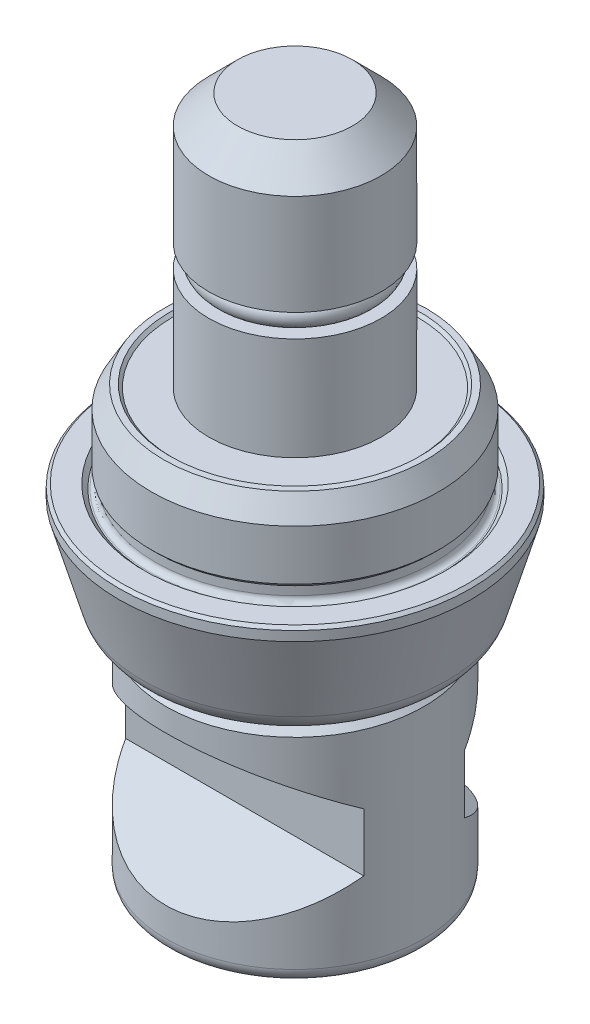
ISO-10303-21;
HEADER;
FILE_DESCRIPTION(('STEP AP214'),'2;1');
FILE_NAME('part.step','',(''),(''),'','','');
FILE_SCHEMA(('AUTOMOTIVE_DESIGN { 1 0 10303 214 1 1 1 1 }'));
ENDSEC;
DATA;
#1=APPLICATION_CONTEXT('core data for automotive mechanical design processes');
#2=APPLICATION_PROTOCOL_DEFINITION('international standard','automotive_design',2000,#1);
#3=PRODUCT_CONTEXT('',#1,'mechanical');
#4=PRODUCT('Part','Part','',(#3));
#5=PRODUCT_RELATED_PRODUCT_CATEGORY('part','',(#4));
#6=PRODUCT_DEFINITION_FORMATION('','',#4);
#7=PRODUCT_DEFINITION_CONTEXT('part definition',#1,'design');
#8=PRODUCT_DEFINITION('design','',#6,#7);
#9=PRODUCT_DEFINITION_SHAPE('','',#8);
#10=(LENGTH_UNIT() NAMED_UNIT(*) SI_UNIT(.MILLI.,.METRE.));
#11=(NAMED_UNIT(*) PLANE_ANGLE_UNIT() SI_UNIT($,.RADIAN.));
#12=(NAMED_UNIT(*) SI_UNIT($,.STERADIAN.) SOLID_ANGLE_UNIT());
#13=UNCERTAINTY_MEASURE_WITH_UNIT(LENGTH_MEASURE(1.E-05),#10,'distance_accuracy_value','');
#14=(GEOMETRIC_REPRESENTATION_CONTEXT(3) GLOBAL_UNCERTAINTY_ASSIGNED_CONTEXT((#13)) GLOBAL_UNIT_ASSIGNED_CONTEXT((#10,
#11,#12)) REPRESENTATION_CONTEXT('',''));
#15=CARTESIAN_POINT('',(0.,0.,0.));
#16=DIRECTION('',(0.,0.,1.));
#17=DIRECTION('',(1.,0.,0.));
#18=AXIS2_PLACEMENT_3D('',#15,#16,#17);
#19=CARTESIAN_POINT('',(0.,-8.4375,0.));
#20=DIRECTION('',(0.,-1.,0.));
#21=DIRECTION('',(0.,0.,1.));
#22=AXIS2_PLACEMENT_3D('',#19,#20,#21);
#23=CYLINDRICAL_SURFACE('',#22,6.);
#24=CARTESIAN_POINT('',(0.,-8.0375,0.));
#25=DIRECTION('',(0.,1.,0.));
#26=DIRECTION('',(0.,0.,-1.));
#27=AXIS2_PLACEMENT_3D('',#24,#25,#26);
#28=CIRCLE('',#27,6.);
#29=CARTESIAN_POINT('',(0.,-8.0375,-6.));
#30=VERTEX_POINT('',#29);
#31=EDGE_CURVE('E172',#30,#30,#28,.T.);
#32=ORIENTED_EDGE('',*,*,#31,.T.);
#33=EDGE_LOOP('',(#32));
#34=FACE_BOUND('',#33,.T.);
#35=CARTESIAN_POINT('',(0.,-7.8,0.));
#36=DIRECTION('',(0.,1.,0.));
#37=DIRECTION('',(0.,0.,1.));
#38=AXIS2_PLACEMENT_3D('',#35,#36,#37);
#39=CIRCLE('',#38,6.);
#40=CARTESIAN_POINT('',(0.,-7.8,6.));
#41=VERTEX_POINT('',#40);
#42=EDGE_CURVE('E695',#41,#41,#39,.F.);
#43=ORIENTED_EDGE('',*,*,#42,.T.);
#44=EDGE_LOOP('',(#43));
#45=FACE_BOUND('',#44,.T.);
#46=ADVANCED_FACE('F16',(#34,#45),#23,.T.);
#47=CARTESIAN_POINT('',(9.,-23.9375,0.));
#48=DIRECTION('',(0.,-1.,0.));
#49=DIRECTION('',(-1.,0.,0.));
#50=AXIS2_PLACEMENT_3D('',#47,#48,#49);
#51=PLANE('',#50);
#52=CARTESIAN_POINT('',(0.,-23.9375,0.));
#53=DIRECTION('',(0.,1.,0.));
#54=DIRECTION('',(0.,0.,-1.));
#55=AXIS2_PLACEMENT_3D('',#52,#53,#54);
#56=CIRCLE('',#55,3.2);
#57=CARTESIAN_POINT('',(0.,-23.9375,-3.2));
#58=VERTEX_POINT('',#57);
#59=EDGE_CURVE('E693',#58,#58,#56,.T.);
#60=ORIENTED_EDGE('',*,*,#59,.T.);
#61=EDGE_LOOP('',(#60));
#62=FACE_BOUND('',#61,.T.);
#63=CARTESIAN_POINT('',(0.,-23.9375,0.));
#64=DIRECTION('',(0.,-1.,0.));
#65=DIRECTION('',(-1.,0.,0.));
#66=AXIS2_PLACEMENT_3D('',#63,#64,#65);
#67=CIRCLE('',#66,8.);
#68=CARTESIAN_POINT('',(-8.,-23.9375,0.));
#69=VERTEX_POINT('',#68);
#70=EDGE_CURVE('E180',#69,#69,#67,.T.);
#71=ORIENTED_EDGE('',*,*,#70,.T.);
#72=EDGE_LOOP('',(#71));
#73=FACE_BOUND('',#72,.T.);
#74=ADVANCED_FACE('F266',(#62,#73),#51,.T.);
#75=CARTESIAN_POINT('',(15.,-17.7620735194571,3.5));
#76=DIRECTION('',(0.,-0.86602540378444,-0.5));
#77=DIRECTION('',(0.,-0.5,0.866025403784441));
#78=AXIS2_PLACEMENT_3D('',#75,#76,#77);
#79=PLANE('',#78);
#80=CARTESIAN_POINT('',(0.,-15.7413475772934,0.));
#81=DIRECTION('',(0.,-0.86602540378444,-0.5));
#82=DIRECTION('',(0.,0.5,-0.866025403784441));
#83=AXIS2_PLACEMENT_3D('',#80,#81,#82);
#84=ELLIPSE('',#83,10.3923048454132,9.);
#85=CARTESIAN_POINT('',(8.2915619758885,-17.7620735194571,3.5));
#86=VERTEX_POINT('',#85);
#87=CARTESIAN_POINT('',(-8.2915619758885,-17.7620735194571,3.5));
#88=VERTEX_POINT('',#87);
#89=EDGE_CURVE('E135',#86,#88,#84,.T.);
#90=ORIENTED_EDGE('',*,*,#89,.F.);
#91=DIRECTION('',(-1.,0.,0.));
#92=VECTOR('',#91,1.);
#93=CARTESIAN_POINT('',(15.,-17.7620735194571,3.5));
#94=LINE('',#93,#92);
#95=EDGE_CURVE('E155',#86,#88,#94,.T.);
#96=ORIENTED_EDGE('',*,*,#95,.T.);
#97=EDGE_LOOP('',(#90,#96));
#98=FACE_BOUND('',#97,.T.);
#99=ADVANCED_FACE('F275',(#98),#79,.F.);
#100=CARTESIAN_POINT('',(15.,-13.7129264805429,3.5));
#101=DIRECTION('',(0.,0.,-1.));
#102=DIRECTION('',(0.,-1.,0.));
#103=AXIS2_PLACEMENT_3D('',#100,#101,#102);
#104=PLANE('',#103);
#105=DIRECTION('',(0.,1.,0.));
#106=VECTOR('',#105,1.);
#107=CARTESIAN_POINT('',(-8.2915619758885,-22.0625,3.5));
#108=LINE('',#107,#106);
#109=CARTESIAN_POINT('',(-8.2915619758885,-13.7129264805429,3.5));
#110=VERTEX_POINT('',#109);
#111=EDGE_CURVE('E138',#88,#110,#108,.T.);
#112=ORIENTED_EDGE('',*,*,#111,.F.);
#113=ORIENTED_EDGE('',*,*,#95,.F.);
#114=DIRECTION('',(0.,1.,0.));
#115=VECTOR('',#114,1.);
#116=CARTESIAN_POINT('',(8.2915619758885,-22.0625,3.5));
#117=LINE('',#116,#115);
#118=CARTESIAN_POINT('',(8.2915619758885,-13.7129264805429,3.5));
#119=VERTEX_POINT('',#118);
#120=EDGE_CURVE('E31',#119,#86,#117,.F.);
#121=ORIENTED_EDGE('',*,*,#120,.F.);
#122=DIRECTION('',(-1.,0.,0.));
#123=VECTOR('',#122,1.);
#124=CARTESIAN_POINT('',(15.,-13.7129264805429,3.5));
#125=LINE('',#124,#123);
#126=EDGE_CURVE('E158',#119,#110,#125,.T.);
#127=ORIENTED_EDGE('',*,*,#126,.T.);
#128=EDGE_LOOP('',(#112,#113,#121,#127));
#129=FACE_BOUND('',#128,.T.);
#130=ADVANCED_FACE('F341',(#129),#104,.F.);
#131=CARTESIAN_POINT('',(15.,-10.2488248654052,9.5));
#132=DIRECTION('',(0.,0.866025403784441,-0.5));
#133=DIRECTION('',(0.,-0.5,-0.86602540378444));
#134=AXIS2_PLACEMENT_3D('',#131,#132,#133);
#135=PLANE('',#134);
#136=CARTESIAN_POINT('',(0.,-15.7336524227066,0.));
#137=DIRECTION('',(0.,0.866025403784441,-0.5));
#138=DIRECTION('',(0.,0.5,0.86602540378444));
#139=AXIS2_PLACEMENT_3D('',#136,#137,#138);
#140=ELLIPSE('',#139,10.3923048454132,9.);
#141=EDGE_CURVE('E140',#110,#119,#140,.T.);
#142=ORIENTED_EDGE('',*,*,#141,.F.);
#143=ORIENTED_EDGE('',*,*,#126,.F.);
#144=EDGE_LOOP('',(#142,#143));
#145=FACE_BOUND('',#144,.T.);
#146=ADVANCED_FACE('F342',(#145),#135,.F.);
#147=CARTESIAN_POINT('',(15.,-17.7620735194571,-3.5));
#148=DIRECTION('',(0.,0.866025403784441,-0.5));
#149=DIRECTION('',(0.,-0.5,-0.866025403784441));
#150=AXIS2_PLACEMENT_3D('',#147,#148,#149);
#151=PLANE('',#150);
#152=DIRECTION('',(-1.,0.,0.));
#153=VECTOR('',#152,1.);
#154=CARTESIAN_POINT('',(15.,-17.7620735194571,-3.5));
#155=LINE('',#154,#153);
#156=CARTESIAN_POINT('',(8.2915619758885,-17.7620735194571,-3.5));
#157=VERTEX_POINT('',#156);
#158=CARTESIAN_POINT('',(-8.2915619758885,-17.7620735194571,-3.5));
#159=VERTEX_POINT('',#158);
#160=EDGE_CURVE('E152',#157,#159,#155,.T.);
#161=ORIENTED_EDGE('',*,*,#160,.F.);
#162=CARTESIAN_POINT('',(0.,-15.7413475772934,0.));
#163=DIRECTION('',(0.,0.866025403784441,-0.5));
#164=DIRECTION('',(0.,0.5,0.866025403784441));
#165=AXIS2_PLACEMENT_3D('',#162,#163,#164);
#166=ELLIPSE('',#165,10.3923048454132,9.);
#167=EDGE_CURVE('E132',#157,#159,#166,.T.);
#168=ORIENTED_EDGE('',*,*,#167,.T.);
#169=EDGE_LOOP('',(#161,#168));
#170=FACE_BOUND('',#169,.T.);
#171=ADVANCED_FACE('F344',(#170),#151,.T.);
#172=CARTESIAN_POINT('',(15.,-10.2488248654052,-9.5));
#173=DIRECTION('',(0.,-0.86602540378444,-0.5));
#174=DIRECTION('',(0.,-0.5,0.86602540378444));
#175=AXIS2_PLACEMENT_3D('',#172,#173,#174);
#176=PLANE('',#175);
#177=DIRECTION('',(-1.,0.,0.));
#178=VECTOR('',#177,1.);
#179=CARTESIAN_POINT('',(15.,-13.7129264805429,-3.5));
#180=LINE('',#179,#178);
#181=CARTESIAN_POINT('',(8.2915619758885,-13.7129264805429,-3.5));
#182=VERTEX_POINT('',#181);
#183=CARTESIAN_POINT('',(-8.2915619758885,-13.7129264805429,-3.5));
#184=VERTEX_POINT('',#183);
#185=EDGE_CURVE('E151',#182,#184,#180,.T.);
#186=ORIENTED_EDGE('',*,*,#185,.T.);
#187=CARTESIAN_POINT('',(0.,-15.7336524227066,0.));
#188=DIRECTION('',(0.,-0.86602540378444,-0.5));
#189=DIRECTION('',(0.,0.5,-0.86602540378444));
#190=AXIS2_PLACEMENT_3D('',#187,#188,#189);
#191=ELLIPSE('',#190,10.3923048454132,9.);
#192=EDGE_CURVE('E175',#184,#182,#191,.T.);
#193=ORIENTED_EDGE('',*,*,#192,.T.);
#194=EDGE_LOOP('',(#186,#193));
#195=FACE_BOUND('',#194,.T.);
#196=ADVANCED_FACE('F328',(#195),#176,.T.);
#197=CARTESIAN_POINT('',(15.,-13.7129264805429,-3.5));
#198=DIRECTION('',(0.,0.,-1.));
#199=DIRECTION('',(0.,-1.,0.));
#200=AXIS2_PLACEMENT_3D('',#197,#198,#199);
#201=PLANE('',#200);
#202=ORIENTED_EDGE('',*,*,#160,.T.);
#203=DIRECTION('',(0.,1.,0.));
#204=VECTOR('',#203,1.);
#205=CARTESIAN_POINT('',(-8.2915619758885,-22.0625,-3.5));
#206=LINE('',#205,#204);
#207=EDGE_CURVE('E129',#159,#184,#206,.T.);
#208=ORIENTED_EDGE('',*,*,#207,.T.);
#209=ORIENTED_EDGE('',*,*,#185,.F.);
#210=DIRECTION('',(0.,1.,0.));
#211=VECTOR('',#210,1.);
#212=CARTESIAN_POINT('',(8.2915619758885,-22.0625,-3.5));
#213=LINE('',#212,#211);
#214=EDGE_CURVE('E39',#182,#157,#213,.F.);
#215=ORIENTED_EDGE('',*,*,#214,.T.);
#216=EDGE_LOOP('',(#202,#208,#209,#215));
#217=FACE_BOUND('',#216,.T.);
#218=ADVANCED_FACE('F319',(#217),#201,.T.);
#219=CARTESIAN_POINT('',(0.,-22.9375,0.));
#220=DIRECTION('',(0.,-1.,0.));
#221=DIRECTION('',(-1.,0.,0.));
#222=AXIS2_PLACEMENT_3D('',#219,#220,#221);
#223=TOROIDAL_SURFACE('',#222,8.,1.);
#224=ORIENTED_EDGE('',*,*,#70,.F.);
#225=EDGE_LOOP('',(#224));
#226=FACE_BOUND('',#225,.T.);
#227=CARTESIAN_POINT('',(0.,-22.9375,0.));
#228=DIRECTION('',(0.,-1.,0.));
#229=DIRECTION('',(-1.,0.,0.));
#230=AXIS2_PLACEMENT_3D('',#227,#228,#229);
#231=CIRCLE('',#230,9.);
#232=CARTESIAN_POINT('',(-9.,-22.9375,0.));
#233=VERTEX_POINT('',#232);
#234=EDGE_CURVE('E177',#233,#233,#231,.F.);
#235=ORIENTED_EDGE('',*,*,#234,.F.);
#236=EDGE_LOOP('',(#235));
#237=FACE_BOUND('',#236,.T.);
#238=ADVANCED_FACE('F316',(#226,#237),#223,.T.);
#239=CARTESIAN_POINT('',(0.,-22.0625,0.));
#240=DIRECTION('',(0.,1.,0.));
#241=DIRECTION('',(0.,0.,-1.));
#242=AXIS2_PLACEMENT_3D('',#239,#240,#241);
#243=CYLINDRICAL_SURFACE('',#242,9.);
#244=CARTESIAN_POINT('',(0.,-8.9375,0.));
#245=DIRECTION('',(0.,1.,0.));
#246=DIRECTION('',(0.,0.,-1.));
#247=AXIS2_PLACEMENT_3D('',#244,#245,#246);
#248=CIRCLE('',#247,9.);
#249=CARTESIAN_POINT('',(0.,-8.9375,-9.));
#250=VERTEX_POINT('',#249);
#251=EDGE_CURVE('E103',#250,#250,#248,.F.);
#252=ORIENTED_EDGE('',*,*,#251,.T.);
#253=EDGE_LOOP('',(#252));
#254=FACE_BOUND('',#253,.T.);
#255=ORIENTED_EDGE('',*,*,#234,.T.);
#256=EDGE_LOOP('',(#255));
#257=FACE_BOUND('',#256,.T.);
#258=ORIENTED_EDGE('',*,*,#214,.F.);
#259=ORIENTED_EDGE('',*,*,#192,.F.);
#260=ORIENTED_EDGE('',*,*,#207,.F.);
#261=ORIENTED_EDGE('',*,*,#167,.F.);
#262=EDGE_LOOP('',(#258,#259,#260,#261));
#263=FACE_BOUND('',#262,.T.);
#264=ORIENTED_EDGE('',*,*,#141,.T.);
#265=ORIENTED_EDGE('',*,*,#120,.T.);
#266=ORIENTED_EDGE('',*,*,#89,.T.);
#267=ORIENTED_EDGE('',*,*,#111,.T.);
#268=EDGE_LOOP('',(#264,#265,#266,#267));
#269=FACE_BOUND('',#268,.T.);
#270=ADVANCED_FACE('F318',(#254,#257,#263,#269),#243,.T.);
#271=CARTESIAN_POINT('',(0.,-8.4375,0.));
#272=DIRECTION('',(0.,-1.,0.));
#273=DIRECTION('',(0.,0.,1.));
#274=AXIS2_PLACEMENT_3D('',#271,#272,#273);
#275=CONICAL_SURFACE('',#274,8.5,0.785398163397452);
#276=ORIENTED_EDGE('',*,*,#251,.F.);
#277=EDGE_LOOP('',(#276));
#278=FACE_BOUND('',#277,.T.);
#279=CARTESIAN_POINT('',(0.,-8.4375,0.));
#280=DIRECTION('',(0.,1.,0.));
#281=DIRECTION('',(0.,0.,-1.));
#282=AXIS2_PLACEMENT_3D('',#279,#280,#281);
#283=CIRCLE('',#282,8.5);
#284=CARTESIAN_POINT('',(0.,-8.4375,-8.5));
#285=VERTEX_POINT('',#284);
#286=EDGE_CURVE('E183',#285,#285,#283,.T.);
#287=ORIENTED_EDGE('',*,*,#286,.F.);
#288=EDGE_LOOP('',(#287));
#289=FACE_BOUND('',#288,.T.);
#290=ADVANCED_FACE('F18',(#278,#289),#275,.T.);
#291=CARTESIAN_POINT('',(0.,-8.4375,0.));
#292=DIRECTION('',(0.,1.,0.));
#293=DIRECTION('',(0.,0.,-1.));
#294=AXIS2_PLACEMENT_3D('',#291,#292,#293);
#295=PLANE('',#294);
#296=ORIENTED_EDGE('',*,*,#286,.T.);
#297=EDGE_LOOP('',(#296));
#298=FACE_BOUND('',#297,.T.);
#299=CARTESIAN_POINT('',(0.,-8.4375,0.));
#300=DIRECTION('',(0.,1.,0.));
#301=DIRECTION('',(0.,0.,-1.));
#302=AXIS2_PLACEMENT_3D('',#299,#300,#301);
#303=CIRCLE('',#302,6.4);
#304=CARTESIAN_POINT('',(0.,-8.4375,-6.4));
#305=VERTEX_POINT('',#304);
#306=EDGE_CURVE('E169',#305,#305,#303,.F.);
#307=ORIENTED_EDGE('',*,*,#306,.T.);
#308=EDGE_LOOP('',(#307));
#309=FACE_BOUND('',#308,.T.);
#310=ADVANCED_FACE('F314',(#298,#309),#295,.T.);
#311=CARTESIAN_POINT('',(0.,-8.0375,0.));
#312=DIRECTION('',(0.,1.,0.));
#313=DIRECTION('',(0.,0.,-1.));
#314=AXIS2_PLACEMENT_3D('',#311,#312,#313);
#315=TOROIDAL_SURFACE('',#314,6.4,0.4);
#316=ORIENTED_EDGE('',*,*,#31,.F.);
#317=EDGE_LOOP('',(#316));
#318=FACE_BOUND('',#317,.T.);
#319=ORIENTED_EDGE('',*,*,#306,.F.);
#320=EDGE_LOOP('',(#319));
#321=FACE_BOUND('',#320,.T.);
#322=ADVANCED_FACE('F204',(#318,#321),#315,.F.);
#323=CARTESIAN_POINT('',(0.,-23.9375,0.));
#324=DIRECTION('',(0.,-1.,0.));
#325=DIRECTION('',(0.,0.,1.));
#326=AXIS2_PLACEMENT_3D('',#323,#324,#325);
#327=CONICAL_SURFACE('',#326,3.2,1.0471975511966);
#328=ORIENTED_EDGE('',*,*,#59,.F.);
#329=EDGE_LOOP('',(#328));
#330=FACE_BOUND('',#329,.T.);
#331=CARTESIAN_POINT('',(-0.000200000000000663,-23.7567124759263,2.88686681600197));
#332=CARTESIAN_POINT('',(0.109663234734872,-23.7200764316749,2.82343724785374));
#333=CARTESIAN_POINT('',(0.220474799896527,-23.6867570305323,2.75946016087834));
#334=CARTESIAN_POINT('',(0.444016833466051,-23.6285970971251,2.63039810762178));
#335=CARTESIAN_POINT('',(0.55675127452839,-23.603777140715,2.56531084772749));
#336=CARTESIAN_POINT('',(0.780822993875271,-23.5651404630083,2.43594298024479));
#337=CARTESIAN_POINT('',(0.892125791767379,-23.5510666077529,2.37168227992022));
#338=CARTESIAN_POINT('',(1.11525522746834,-23.53426396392,2.24285844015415));
#339=CARTESIAN_POINT('',(1.22708105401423,-23.5315212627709,2.17829576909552));
#340=CARTESIAN_POINT('',(1.43604197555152,-23.5372205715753,2.05765212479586));
#341=CARTESIAN_POINT('',(1.53320831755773,-23.5442632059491,2.0015531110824));
#342=CARTESIAN_POINT('',(1.726907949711,-23.5665862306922,1.88972057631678));
#343=CARTESIAN_POINT('',(1.82344056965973,-23.5818742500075,1.8339874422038));
#344=CARTESIAN_POINT('',(2.01753972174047,-23.6200939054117,1.7219242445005));
#345=CARTESIAN_POINT('',(2.11508168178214,-23.6431875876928,1.66560836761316));
#346=CARTESIAN_POINT('',(2.30871060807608,-23.6956014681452,1.55381665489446));
#347=CARTESIAN_POINT('',(2.40480005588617,-23.7249093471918,1.49833938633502));
#348=CARTESIAN_POINT('',(2.5002,-23.7567124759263,1.44326020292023));
#349=B_SPLINE_CURVE_WITH_KNOTS('',3,(#331,#332,#333,#334,#335,#336,#337,#338,#339,#340,#341,
#342,#343,#344,#345,#346,#347,#348),.UNSPECIFIED.,.F.,.F.,(4,2,2,2,2,2,2,2,4),(0.,
0.396285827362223,0.793524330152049,1.18093086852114,1.56786160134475,1.90479741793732,
2.24204551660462,2.58677531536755,2.93082800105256),.UNSPECIFIED.);
#350=CARTESIAN_POINT('',(0.,-23.7566458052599,2.88675134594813));
#351=VERTEX_POINT('',#350);
#352=CARTESIAN_POINT('',(2.5,-23.7566458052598,1.44337567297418));
#353=VERTEX_POINT('',#352);
#354=EDGE_CURVE('E95',#351,#353,#349,.T.);
#355=ORIENTED_EDGE('',*,*,#354,.T.);
#356=CARTESIAN_POINT('',(2.5,-24.9909184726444,4.35847990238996));
#357=CARTESIAN_POINT('',(2.5,-24.9387419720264,4.25428000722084));
#358=CARTESIAN_POINT('',(2.5,-24.8869226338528,4.14989938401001));
#359=CARTESIAN_POINT('',(2.5,-24.7841728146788,3.94069776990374));
#360=CARTESIAN_POINT('',(2.5,-24.733242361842,3.83587676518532));
#361=CARTESIAN_POINT('',(2.5,-24.6323473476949,3.62551184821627));
#362=CARTESIAN_POINT('',(2.5,-24.5823849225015,3.51996690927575));
#363=CARTESIAN_POINT('',(2.5,-24.4837694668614,3.30826399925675));
#364=CARTESIAN_POINT('',(2.5,-24.4351164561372,3.20210601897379));
#365=CARTESIAN_POINT('',(2.5,-24.3372579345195,2.984239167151));
#366=CARTESIAN_POINT('',(2.5,-24.2881271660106,2.87249661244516));
#367=CARTESIAN_POINT('',(2.5,-24.1920858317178,2.64806241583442));
#368=CARTESIAN_POINT('',(2.5,-24.1451751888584,2.53537080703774));
#369=CARTESIAN_POINT('',(2.5,-24.054206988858,2.3089356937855));
#370=CARTESIAN_POINT('',(2.5,-24.0101472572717,2.19519306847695));
#371=CARTESIAN_POINT('',(2.5,-23.9256215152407,1.96633759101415));
#372=CARTESIAN_POINT('',(2.5,-23.8851565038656,1.85122436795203));
#373=CARTESIAN_POINT('',(2.5,-23.8000020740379,1.59257909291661));
#374=CARTESIAN_POINT('',(2.5,-23.7565084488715,1.44864606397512));
#375=CARTESIAN_POINT('',(2.5,-23.6790121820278,1.15827909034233));
#376=CARTESIAN_POINT('',(2.5,-23.6450039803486,1.01184666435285));
#377=CARTESIAN_POINT('',(2.5,-23.5897899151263,0.719069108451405));
#378=CARTESIAN_POINT('',(2.5,-23.5683779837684,0.572764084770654));
#379=CARTESIAN_POINT('',(2.5,-23.5398968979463,0.278772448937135));
#380=CARTESIAN_POINT('',(2.5,-23.5328215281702,0.131086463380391));
#381=CARTESIAN_POINT('',(2.5,-23.5339550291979,-0.165148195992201));
#382=CARTESIAN_POINT('',(2.5,-23.5422596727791,-0.313696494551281));
#383=CARTESIAN_POINT('',(2.5,-23.5732234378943,-0.609297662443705));
#384=CARTESIAN_POINT('',(2.5,-23.5958892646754,-0.756349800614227));
#385=CARTESIAN_POINT('',(2.5,-23.6535393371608,-1.05056792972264));
#386=CARTESIAN_POINT('',(2.5,-23.6887284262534,-1.19769251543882));
#387=CARTESIAN_POINT('',(2.5,-23.768452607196,-1.48941876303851));
#388=CARTESIAN_POINT('',(2.5,-23.8129930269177,-1.63401893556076));
#389=CARTESIAN_POINT('',(2.5,-23.899077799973,-1.89132457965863));
#390=CARTESIAN_POINT('',(2.5,-23.939349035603,-2.00446376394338));
#391=CARTESIAN_POINT('',(2.5,-24.0232846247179,-2.22943504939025));
#392=CARTESIAN_POINT('',(2.5,-24.0669480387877,-2.341267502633));
#393=CARTESIAN_POINT('',(2.5,-24.1569736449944,-2.56392567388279));
#394=CARTESIAN_POINT('',(2.5,-24.2033377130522,-2.67475062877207));
#395=CARTESIAN_POINT('',(2.5,-24.2981795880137,-2.89549327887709));
#396=CARTESIAN_POINT('',(2.5,-24.3466574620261,-3.00541094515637));
#397=CARTESIAN_POINT('',(2.5,-24.4431907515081,-3.21980106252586));
#398=CARTESIAN_POINT('',(2.5,-24.4911756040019,-3.3243053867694));
#399=CARTESIAN_POINT('',(2.5,-24.5884034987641,-3.53272405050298));
#400=CARTESIAN_POINT('',(2.5,-24.637646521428,-3.63663839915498));
#401=CARTESIAN_POINT('',(2.5,-24.7370748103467,-3.84378201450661));
#402=CARTESIAN_POINT('',(2.5,-24.7872582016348,-3.94701218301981));
#403=CARTESIAN_POINT('',(2.5,-24.8884849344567,-4.15304668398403));
#404=CARTESIAN_POINT('',(2.5,-24.9395282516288,-4.2558510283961));
#405=CARTESIAN_POINT('',(2.5,-24.9909184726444,-4.35847990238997));
#406=B_SPLINE_CURVE_WITH_KNOTS('',3,(#356,#357,#358,#359,#360,#361,#362,#363,#364,#365,#366,
#367,#368,#369,#370,#371,#372,#373,#374,#375,#376,#377,#378,#379,#380,#381,#382,#383,#384,#385,
#386,#387,#388,#389,#390,#391,#392,#393,#394,#395,#396,#397,#398,#399,#400,#401,#402,#403,#404,
#405),.UNSPECIFIED.,.F.,.F.,(4,2,2,2,2,2,2,2,2,2,2,2,2,2,2,2,2,2,2,2,2,2,2,2,4),(0.,
0.349601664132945,0.699214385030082,1.04952651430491,1.39984391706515,1.7660243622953,
2.13219208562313,2.49807715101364,2.86406358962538,3.3149052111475,3.76548200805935,
4.20846642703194,4.65125875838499,5.0968176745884,5.54258477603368,5.99600640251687,
6.44968706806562,6.80990389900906,7.17002132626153,7.53039195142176,7.8907740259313,
8.23574717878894,8.58071495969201,8.92505583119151,9.26938696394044),.UNSPECIFIED.);
#407=CARTESIAN_POINT('',(2.5,-23.7566458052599,-1.44337567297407));
#408=VERTEX_POINT('',#407);
#409=EDGE_CURVE('E114',#353,#408,#406,.T.);
#410=ORIENTED_EDGE('',*,*,#409,.T.);
#411=CARTESIAN_POINT('',(2.5002,-23.7567124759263,-1.44326020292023));
#412=CARTESIAN_POINT('',(2.39033676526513,-23.7200764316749,-1.50668977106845));
#413=CARTESIAN_POINT('',(2.27952520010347,-23.6867570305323,-1.57066685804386));
#414=CARTESIAN_POINT('',(2.05598316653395,-23.6285970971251,-1.69972891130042));
#415=CARTESIAN_POINT('',(1.94324872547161,-23.603777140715,-1.7648161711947));
#416=CARTESIAN_POINT('',(1.71917700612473,-23.5651404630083,-1.8941840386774));
#417=CARTESIAN_POINT('',(1.60787420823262,-23.5510666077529,-1.95844473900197));
#418=CARTESIAN_POINT('',(1.38474477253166,-23.53426396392,-2.08726857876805));
#419=CARTESIAN_POINT('',(1.27291894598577,-23.5315212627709,-2.15183124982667));
#420=CARTESIAN_POINT('',(1.06395802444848,-23.5372205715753,-2.27247489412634));
#421=CARTESIAN_POINT('',(0.966791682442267,-23.5442632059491,-2.3285739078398));
#422=CARTESIAN_POINT('',(0.773092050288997,-23.5665862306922,-2.44040644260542));
#423=CARTESIAN_POINT('',(0.676559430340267,-23.5818742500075,-2.4961395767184));
#424=CARTESIAN_POINT('',(0.482460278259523,-23.6200939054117,-2.60820277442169));
#425=CARTESIAN_POINT('',(0.384918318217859,-23.6431875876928,-2.66451865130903));
#426=CARTESIAN_POINT('',(0.191289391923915,-23.6956014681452,-2.77631036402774));
#427=CARTESIAN_POINT('',(0.095199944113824,-23.7249093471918,-2.83178763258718));
#428=CARTESIAN_POINT('',(-0.000200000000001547,-23.7567124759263,-2.88686681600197));
#429=B_SPLINE_CURVE_WITH_KNOTS('',3,(#411,#412,#413,#414,#415,#416,#417,#418,#419,#420,#421,
#422,#423,#424,#425,#426,#427,#428),.UNSPECIFIED.,.F.,.F.,(4,2,2,2,2,2,2,2,4),(0.,
0.396285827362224,0.793524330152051,1.18093086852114,1.56786160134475,1.90479741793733,
2.24204551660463,2.58677531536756,2.93082800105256),.UNSPECIFIED.);
#430=CARTESIAN_POINT('',(0.,-23.7566458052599,-2.88675134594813));
#431=VERTEX_POINT('',#430);
#432=EDGE_CURVE('E228',#408,#431,#429,.T.);
#433=ORIENTED_EDGE('',*,*,#432,.T.);
#434=CARTESIAN_POINT('',(0.000199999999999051,-23.7567124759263,-2.88686681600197));
#435=CARTESIAN_POINT('',(-0.109663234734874,-23.7200764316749,-2.82343724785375));
#436=CARTESIAN_POINT('',(-0.220474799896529,-23.6867570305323,-2.75946016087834));
#437=CARTESIAN_POINT('',(-0.444016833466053,-23.6285970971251,-2.63039810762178));
#438=CARTESIAN_POINT('',(-0.556751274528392,-23.603777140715,-2.5653108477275));
#439=CARTESIAN_POINT('',(-0.780822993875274,-23.5651404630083,-2.43594298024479));
#440=CARTESIAN_POINT('',(-0.892125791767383,-23.5510666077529,-2.37168227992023));
#441=CARTESIAN_POINT('',(-1.11525522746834,-23.53426396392,-2.24285844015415));
#442=CARTESIAN_POINT('',(-1.22708105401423,-23.5315212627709,-2.17829576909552));
#443=CARTESIAN_POINT('',(-1.43604197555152,-23.5372205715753,-2.05765212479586));
#444=CARTESIAN_POINT('',(-1.53320831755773,-23.5442632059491,-2.0015531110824));
#445=CARTESIAN_POINT('',(-1.726907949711,-23.5665862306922,-1.88972057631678));
#446=CARTESIAN_POINT('',(-1.82344056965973,-23.5818742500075,-1.8339874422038));
#447=CARTESIAN_POINT('',(-2.01753972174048,-23.6200939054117,-1.7219242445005));
#448=CARTESIAN_POINT('',(-2.11508168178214,-23.6431875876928,-1.66560836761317));
#449=CARTESIAN_POINT('',(-2.30871060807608,-23.6956014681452,-1.55381665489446));
#450=CARTESIAN_POINT('',(-2.40480005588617,-23.7249093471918,-1.49833938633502));
#451=CARTESIAN_POINT('',(-2.5002,-23.7567124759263,-1.44326020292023));
#452=B_SPLINE_CURVE_WITH_KNOTS('',3,(#434,#435,#436,#437,#438,#439,#440,#441,#442,#443,#444,
#445,#446,#447,#448,#449,#450,#451),.UNSPECIFIED.,.F.,.F.,(4,2,2,2,2,2,2,2,4),(0.,
0.396285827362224,0.793524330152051,1.18093086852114,1.56786160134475,1.90479741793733,
2.24204551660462,2.58677531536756,2.93082800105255),.UNSPECIFIED.);
#453=CARTESIAN_POINT('',(-2.5,-23.7566458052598,-1.44337567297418));
#454=VERTEX_POINT('',#453);
#455=EDGE_CURVE('E221',#431,#454,#452,.T.);
#456=ORIENTED_EDGE('',*,*,#455,.T.);
#457=CARTESIAN_POINT('',(-2.5,-24.9909184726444,-4.35847990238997));
#458=CARTESIAN_POINT('',(-2.5,-24.9387419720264,-4.25428000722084));
#459=CARTESIAN_POINT('',(-2.5,-24.8869226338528,-4.14989938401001));
#460=CARTESIAN_POINT('',(-2.5,-24.7841728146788,-3.94069776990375));
#461=CARTESIAN_POINT('',(-2.5,-24.733242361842,-3.83587676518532));
#462=CARTESIAN_POINT('',(-2.5,-24.6323473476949,-3.62551184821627));
#463=CARTESIAN_POINT('',(-2.5,-24.5823849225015,-3.51996690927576));
#464=CARTESIAN_POINT('',(-2.5,-24.4837694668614,-3.30826399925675));
#465=CARTESIAN_POINT('',(-2.5,-24.4351164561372,-3.2021060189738));
#466=CARTESIAN_POINT('',(-2.5,-24.3372579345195,-2.98423916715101));
#467=CARTESIAN_POINT('',(-2.5,-24.2881271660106,-2.87249661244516));
#468=CARTESIAN_POINT('',(-2.5,-24.1920858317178,-2.64806241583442));
#469=CARTESIAN_POINT('',(-2.5,-24.1451751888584,-2.53537080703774));
#470=CARTESIAN_POINT('',(-2.5,-24.054206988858,-2.3089356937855));
#471=CARTESIAN_POINT('',(-2.5,-24.0101472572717,-2.19519306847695));
#472=CARTESIAN_POINT('',(-2.5,-23.9256215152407,-1.96633759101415));
#473=CARTESIAN_POINT('',(-2.5,-23.8851565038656,-1.85122436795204));
#474=CARTESIAN_POINT('',(-2.5,-23.8000020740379,-1.59257909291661));
#475=CARTESIAN_POINT('',(-2.5,-23.7565084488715,-1.44864606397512));
#476=CARTESIAN_POINT('',(-2.5,-23.6790121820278,-1.15827909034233));
#477=CARTESIAN_POINT('',(-2.5,-23.6450039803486,-1.01184666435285));
#478=CARTESIAN_POINT('',(-2.5,-23.5897899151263,-0.719069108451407));
#479=CARTESIAN_POINT('',(-2.5,-23.5683779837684,-0.572764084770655));
#480=CARTESIAN_POINT('',(-2.5,-23.5398968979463,-0.278772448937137));
#481=CARTESIAN_POINT('',(-2.5,-23.5328215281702,-0.131086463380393));
#482=CARTESIAN_POINT('',(-2.5,-23.5339550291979,0.1651481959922));
#483=CARTESIAN_POINT('',(-2.5,-23.5422596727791,0.313696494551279));
#484=CARTESIAN_POINT('',(-2.5,-23.5732234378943,0.609297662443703));
#485=CARTESIAN_POINT('',(-2.5,-23.5958892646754,0.756349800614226));
#486=CARTESIAN_POINT('',(-2.5,-23.6535393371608,1.05056792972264));
#487=CARTESIAN_POINT('',(-2.5,-23.6887284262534,1.19769251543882));
#488=CARTESIAN_POINT('',(-2.5,-23.768452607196,1.4894187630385));
#489=CARTESIAN_POINT('',(-2.5,-23.8129930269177,1.63401893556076));
#490=CARTESIAN_POINT('',(-2.5,-23.899077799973,1.89132457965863));
#491=CARTESIAN_POINT('',(-2.5,-23.939349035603,2.00446376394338));
#492=CARTESIAN_POINT('',(-2.5,-24.0232846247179,2.22943504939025));
#493=CARTESIAN_POINT('',(-2.5,-24.0669480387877,2.341267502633));
#494=CARTESIAN_POINT('',(-2.5,-24.1569736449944,2.56392567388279));
#495=CARTESIAN_POINT('',(-2.5,-24.2033377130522,2.67475062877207));
#496=CARTESIAN_POINT('',(-2.5,-24.2981795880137,2.89549327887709));
#497=CARTESIAN_POINT('',(-2.5,-24.3466574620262,3.00541094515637));
#498=CARTESIAN_POINT('',(-2.5,-24.4431907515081,3.21980106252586));
#499=CARTESIAN_POINT('',(-2.5,-24.4911756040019,3.3243053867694));
#500=CARTESIAN_POINT('',(-2.5,-24.5884034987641,3.53272405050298));
#501=CARTESIAN_POINT('',(-2.5,-24.637646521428,3.63663839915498));
#502=CARTESIAN_POINT('',(-2.5,-24.7370748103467,3.84378201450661));
#503=CARTESIAN_POINT('',(-2.5,-24.7872582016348,3.94701218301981));
#504=CARTESIAN_POINT('',(-2.5,-24.8884849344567,4.15304668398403));
#505=CARTESIAN_POINT('',(-2.5,-24.9395282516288,4.2558510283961));
#506=CARTESIAN_POINT('',(-2.5,-24.9909184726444,4.35847990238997));
#507=B_SPLINE_CURVE_WITH_KNOTS('',3,(#457,#458,#459,#460,#461,#462,#463,#464,#465,#466,#467,
#468,#469,#470,#471,#472,#473,#474,#475,#476,#477,#478,#479,#480,#481,#482,#483,#484,#485,#486,
#487,#488,#489,#490,#491,#492,#493,#494,#495,#496,#497,#498,#499,#500,#501,#502,#503,#504,#505,
#506),.UNSPECIFIED.,.F.,.F.,(4,2,2,2,2,2,2,2,2,2,2,2,2,2,2,2,2,2,2,2,2,2,2,2,4),(0.,
0.349601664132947,0.699214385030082,1.04952651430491,1.39984391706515,1.7660243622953,
2.13219208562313,2.49807715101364,2.86406358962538,3.3149052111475,3.76548200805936,
4.20846642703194,4.65125875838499,5.0968176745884,5.54258477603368,5.99600640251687,
6.44968706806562,6.80990389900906,7.17002132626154,7.53039195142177,7.8907740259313,
8.23574717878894,8.58071495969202,8.92505583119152,9.26938696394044),.UNSPECIFIED.);
#508=CARTESIAN_POINT('',(-2.5,-23.7566458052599,1.44337567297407));
#509=VERTEX_POINT('',#508);
#510=EDGE_CURVE('E98',#454,#509,#507,.T.);
#511=ORIENTED_EDGE('',*,*,#510,.T.);
#512=CARTESIAN_POINT('',(-2.5002,-23.7567124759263,1.44326020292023));
#513=CARTESIAN_POINT('',(-2.39033676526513,-23.7200764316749,1.50668977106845));
#514=CARTESIAN_POINT('',(-2.27952520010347,-23.6867570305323,1.57066685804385));
#515=CARTESIAN_POINT('',(-2.05598316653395,-23.6285970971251,1.69972891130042));
#516=CARTESIAN_POINT('',(-1.94324872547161,-23.603777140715,1.7648161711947));
#517=CARTESIAN_POINT('',(-1.71917700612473,-23.5651404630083,1.8941840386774));
#518=CARTESIAN_POINT('',(-1.60787420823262,-23.5510666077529,1.95844473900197));
#519=CARTESIAN_POINT('',(-1.38474477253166,-23.53426396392,2.08726857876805));
#520=CARTESIAN_POINT('',(-1.27291894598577,-23.5315212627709,2.15183124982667));
#521=CARTESIAN_POINT('',(-1.06395802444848,-23.5372205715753,2.27247489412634));
#522=CARTESIAN_POINT('',(-0.966791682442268,-23.5442632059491,2.32857390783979));
#523=CARTESIAN_POINT('',(-0.773092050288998,-23.5665862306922,2.44040644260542));
#524=CARTESIAN_POINT('',(-0.676559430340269,-23.5818742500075,2.4961395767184));
#525=CARTESIAN_POINT('',(-0.482460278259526,-23.6200939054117,2.60820277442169));
#526=CARTESIAN_POINT('',(-0.384918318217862,-23.6431875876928,2.66451865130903));
#527=CARTESIAN_POINT('',(-0.191289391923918,-23.6956014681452,2.77631036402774));
#528=CARTESIAN_POINT('',(-0.0951999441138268,-23.7249093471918,2.83178763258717));
#529=CARTESIAN_POINT('',(0.000199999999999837,-23.7567124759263,2.88686681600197));
#530=B_SPLINE_CURVE_WITH_KNOTS('',3,(#512,#513,#514,#515,#516,#517,#518,#519,#520,#521,#522,
#523,#524,#525,#526,#527,#528,#529),.UNSPECIFIED.,.F.,.F.,(4,2,2,2,2,2,2,2,4),(0.,
0.396285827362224,0.79352433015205,1.18093086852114,1.56786160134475,1.90479741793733,
2.24204551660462,2.58677531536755,2.93082800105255),.UNSPECIFIED.);
#531=EDGE_CURVE('E92',#509,#351,#530,.T.);
#532=ORIENTED_EDGE('',*,*,#531,.T.);
#533=EDGE_LOOP('',(#355,#410,#433,#456,#511,#532));
#534=FACE_BOUND('',#533,.T.);
#535=ADVANCED_FACE('F94',(#330,#534),#327,.F.);
#536=CARTESIAN_POINT('',(0.,-20.4375,0.));
#537=DIRECTION('',(0.,-1.,0.));
#538=DIRECTION('',(0.,0.,1.));
#539=AXIS2_PLACEMENT_3D('',#536,#537,#538);
#540=PLANE('',#539);
#541=DIRECTION('',(0.,0.,1.));
#542=VECTOR('',#541,1.);
#543=CARTESIAN_POINT('',(2.5,-20.4375,-1.44337567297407));
#544=LINE('',#543,#542);
#545=CARTESIAN_POINT('',(2.5,-20.4375,-1.44337567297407));
#546=VERTEX_POINT('',#545);
#547=CARTESIAN_POINT('',(2.5,-20.4375,1.44337567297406));
#548=VERTEX_POINT('',#547);
#549=EDGE_CURVE('E120',#546,#548,#544,.T.);
#550=ORIENTED_EDGE('',*,*,#549,.T.);
#551=DIRECTION('',(-0.866025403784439,0.,0.5));
#552=VECTOR('',#551,1.);
#553=CARTESIAN_POINT('',(2.5,-20.4375,1.44337567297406));
#554=LINE('',#553,#552);
#555=CARTESIAN_POINT('',(0.,-20.4375,2.88675134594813));
#556=VERTEX_POINT('',#555);
#557=EDGE_CURVE('E113',#548,#556,#554,.T.);
#558=ORIENTED_EDGE('',*,*,#557,.T.);
#559=DIRECTION('',(-0.866025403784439,0.,-0.5));
#560=VECTOR('',#559,1.);
#561=CARTESIAN_POINT('',(0.,-20.4375,2.88675134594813));
#562=LINE('',#561,#560);
#563=CARTESIAN_POINT('',(-2.5,-20.4375,1.44337567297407));
#564=VERTEX_POINT('',#563);
#565=EDGE_CURVE('E117',#556,#564,#562,.T.);
#566=ORIENTED_EDGE('',*,*,#565,.T.);
#567=DIRECTION('',(0.,0.,-1.));
#568=VECTOR('',#567,1.);
#569=CARTESIAN_POINT('',(-2.5,-20.4375,1.44337567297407));
#570=LINE('',#569,#568);
#571=CARTESIAN_POINT('',(-2.5,-20.4375,-1.44337567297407));
#572=VERTEX_POINT('',#571);
#573=EDGE_CURVE('E741',#564,#572,#570,.T.);
#574=ORIENTED_EDGE('',*,*,#573,.T.);
#575=DIRECTION('',(0.866025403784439,0.,-0.5));
#576=VECTOR('',#575,1.);
#577=CARTESIAN_POINT('',(-2.5,-20.4375,-1.44337567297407));
#578=LINE('',#577,#576);
#579=CARTESIAN_POINT('',(0.,-20.4375,-2.88675134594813));
#580=VERTEX_POINT('',#579);
#581=EDGE_CURVE('E739',#572,#580,#578,.T.);
#582=ORIENTED_EDGE('',*,*,#581,.T.);
#583=DIRECTION('',(0.866025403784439,0.,0.5));
#584=VECTOR('',#583,1.);
#585=CARTESIAN_POINT('',(0.,-20.4375,-2.88675134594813));
#586=LINE('',#585,#584);
#587=EDGE_CURVE('E124',#580,#546,#586,.T.);
#588=ORIENTED_EDGE('',*,*,#587,.T.);
#589=EDGE_LOOP('',(#550,#558,#566,#574,#582,#588));
#590=FACE_BOUND('',#589,.T.);
#591=ADVANCED_FACE('F203',(#590),#540,.T.);
#592=CARTESIAN_POINT('',(0.,-20.4375,2.88675134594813));
#593=DIRECTION('',(-0.5,0.,0.866025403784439));
#594=DIRECTION('',(0.866025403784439,0.,0.5));
#595=AXIS2_PLACEMENT_3D('',#592,#593,#594);
#596=PLANE('',#595);
#597=ORIENTED_EDGE('',*,*,#531,.F.);
#598=DIRECTION('',(0.,-1.,0.));
#599=VECTOR('',#598,1.);
#600=CARTESIAN_POINT('',(-2.5,-20.4375,1.44337567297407));
#601=LINE('',#600,#599);
#602=EDGE_CURVE('E119',#564,#509,#601,.T.);
#603=ORIENTED_EDGE('',*,*,#602,.F.);
#604=ORIENTED_EDGE('',*,*,#565,.F.);
#605=DIRECTION('',(0.,-1.,0.));
#606=VECTOR('',#605,1.);
#607=CARTESIAN_POINT('',(0.,-20.4375,2.88675134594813));
#608=LINE('',#607,#606);
#609=EDGE_CURVE('E110',#556,#351,#608,.T.);
#610=ORIENTED_EDGE('',*,*,#609,.T.);
#611=EDGE_LOOP('',(#597,#603,#604,#610));
#612=FACE_BOUND('',#611,.T.);
#613=ADVANCED_FACE('F116',(#612),#596,.F.);
#614=CARTESIAN_POINT('',(-2.5,-20.4375,1.44337567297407));
#615=DIRECTION('',(-1.,0.,0.));
#616=DIRECTION('',(0.,1.,0.));
#617=AXIS2_PLACEMENT_3D('',#614,#615,#616);
#618=PLANE('',#617);
#619=ORIENTED_EDGE('',*,*,#510,.F.);
#620=DIRECTION('',(0.,-1.,0.));
#621=VECTOR('',#620,1.);
#622=CARTESIAN_POINT('',(-2.5,-20.4375,-1.44337567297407));
#623=LINE('',#622,#621);
#624=EDGE_CURVE('E122',#572,#454,#623,.T.);
#625=ORIENTED_EDGE('',*,*,#624,.F.);
#626=ORIENTED_EDGE('',*,*,#573,.F.);
#627=ORIENTED_EDGE('',*,*,#602,.T.);
#628=EDGE_LOOP('',(#619,#625,#626,#627));
#629=FACE_BOUND('',#628,.T.);
#630=ADVANCED_FACE('F255',(#629),#618,.F.);
#631=CARTESIAN_POINT('',(-2.5,-20.4375,-1.44337567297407));
#632=DIRECTION('',(-0.5,0.,-0.866025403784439));
#633=DIRECTION('',(-0.866025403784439,0.,0.5));
#634=AXIS2_PLACEMENT_3D('',#631,#632,#633);
#635=PLANE('',#634);
#636=ORIENTED_EDGE('',*,*,#455,.F.);
#637=DIRECTION('',(0.,-1.,0.));
#638=VECTOR('',#637,1.);
#639=CARTESIAN_POINT('',(0.,-20.4375,-2.88675134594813));
#640=LINE('',#639,#638);
#641=EDGE_CURVE('E730',#580,#431,#640,.T.);
#642=ORIENTED_EDGE('',*,*,#641,.F.);
#643=ORIENTED_EDGE('',*,*,#581,.F.);
#644=ORIENTED_EDGE('',*,*,#624,.T.);
#645=EDGE_LOOP('',(#636,#642,#643,#644));
#646=FACE_BOUND('',#645,.T.);
#647=ADVANCED_FACE('F251',(#646),#635,.F.);
#648=CARTESIAN_POINT('',(0.,-20.4375,-2.88675134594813));
#649=DIRECTION('',(0.5,0.,-0.866025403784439));
#650=DIRECTION('',(-0.866025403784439,0.,-0.5));
#651=AXIS2_PLACEMENT_3D('',#648,#649,#650);
#652=PLANE('',#651);
#653=ORIENTED_EDGE('',*,*,#432,.F.);
#654=DIRECTION('',(0.,-1.,0.));
#655=VECTOR('',#654,1.);
#656=CARTESIAN_POINT('',(2.5,-20.4375,-1.44337567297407));
#657=LINE('',#656,#655);
#658=EDGE_CURVE('E733',#546,#408,#657,.T.);
#659=ORIENTED_EDGE('',*,*,#658,.F.);
#660=ORIENTED_EDGE('',*,*,#587,.F.);
#661=ORIENTED_EDGE('',*,*,#641,.T.);
#662=EDGE_LOOP('',(#653,#659,#660,#661));
#663=FACE_BOUND('',#662,.T.);
#664=ADVANCED_FACE('F247',(#663),#652,.F.);
#665=CARTESIAN_POINT('',(2.5,-20.4375,-1.44337567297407));
#666=DIRECTION('',(1.,0.,0.));
#667=DIRECTION('',(0.,-1.,0.));
#668=AXIS2_PLACEMENT_3D('',#665,#666,#667);
#669=PLANE('',#668);
#670=ORIENTED_EDGE('',*,*,#409,.F.);
#671=DIRECTION('',(0.,-1.,0.));
#672=VECTOR('',#671,1.);
#673=CARTESIAN_POINT('',(2.5,-20.4375,1.44337567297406));
#674=LINE('',#673,#672);
#675=EDGE_CURVE('E112',#548,#353,#674,.T.);
#676=ORIENTED_EDGE('',*,*,#675,.F.);
#677=ORIENTED_EDGE('',*,*,#549,.F.);
#678=ORIENTED_EDGE('',*,*,#658,.T.);
#679=EDGE_LOOP('',(#670,#676,#677,#678));
#680=FACE_BOUND('',#679,.T.);
#681=ADVANCED_FACE('F244',(#680),#669,.F.);
#682=CARTESIAN_POINT('',(2.5,-20.4375,1.44337567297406));
#683=DIRECTION('',(0.5,0.,0.866025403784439));
#684=DIRECTION('',(0.866025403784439,0.,-0.5));
#685=AXIS2_PLACEMENT_3D('',#682,#683,#684);
#686=PLANE('',#685);
#687=ORIENTED_EDGE('',*,*,#354,.F.);
#688=ORIENTED_EDGE('',*,*,#609,.F.);
#689=ORIENTED_EDGE('',*,*,#557,.F.);
#690=ORIENTED_EDGE('',*,*,#675,.T.);
#691=EDGE_LOOP('',(#687,#688,#689,#690));
#692=FACE_BOUND('',#691,.T.);
#693=ADVANCED_FACE('F108',(#692),#686,.F.);
#694=CARTESIAN_POINT('',(0.,-7.8,0.));
#695=DIRECTION('',(0.,1.,0.));
#696=DIRECTION('',(0.,0.,1.));
#697=AXIS2_PLACEMENT_3D('',#694,#695,#696);
#698=PLANE('',#697);
#699=ORIENTED_EDGE('',*,*,#42,.F.);
#700=EDGE_LOOP('',(#699));
#701=FACE_BOUND('',#700,.T.);
#702=CARTESIAN_POINT('',(0.,-7.8,0.));
#703=DIRECTION('',(0.,1.,0.));
#704=DIRECTION('',(0.,0.,1.));
#705=AXIS2_PLACEMENT_3D('',#702,#703,#704);
#706=CIRCLE('',#705,7.);
#707=CARTESIAN_POINT('',(0.,-7.8,7.));
#708=VERTEX_POINT('',#707);
#709=EDGE_CURVE('E691',#708,#708,#706,.T.);
#710=ORIENTED_EDGE('',*,*,#709,.F.);
#711=EDGE_LOOP('',(#710));
#712=FACE_BOUND('',#711,.T.);
#713=ADVANCED_FACE('F471',(#701,#712),#698,.F.);
#714=CARTESIAN_POINT('',(6.,-8.,0.));
#715=DIRECTION('',(0.,-1.,0.));
#716=DIRECTION('',(0.,0.,-1.));
#717=AXIS2_PLACEMENT_3D('',#714,#715,#716);
#718=PLANE('',#717);
#719=CARTESIAN_POINT('',(0.,-8.,0.));
#720=DIRECTION('',(0.,-1.,0.));
#721=DIRECTION('',(0.,0.,-1.));
#722=AXIS2_PLACEMENT_3D('',#719,#720,#721);
#723=CIRCLE('',#722,7.2);
#724=CARTESIAN_POINT('',(0.,-8.,-7.2));
#725=VERTEX_POINT('',#724);
#726=EDGE_CURVE('E682',#725,#725,#723,.F.);
#727=ORIENTED_EDGE('',*,*,#726,.T.);
#728=EDGE_LOOP('',(#727));
#729=FACE_BOUND('',#728,.T.);
#730=CARTESIAN_POINT('',(0.,-8.,0.));
#731=DIRECTION('',(0.,-1.,0.));
#732=DIRECTION('',(0.,0.,-1.));
#733=AXIS2_PLACEMENT_3D('',#730,#731,#732);
#734=CIRCLE('',#733,8.69892881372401);
#735=CARTESIAN_POINT('',(0.,-8.,-8.69892881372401));
#736=VERTEX_POINT('',#735);
#737=EDGE_CURVE('E658',#736,#736,#734,.T.);
#738=ORIENTED_EDGE('',*,*,#737,.T.);
#739=EDGE_LOOP('',(#738));
#740=FACE_BOUND('',#739,.T.);
#741=ADVANCED_FACE('F478',(#729,#740),#718,.T.);
#742=CARTESIAN_POINT('',(0.,0.,0.));
#743=DIRECTION('',(0.,-1.,0.));
#744=DIRECTION('',(0.,0.,-1.));
#745=AXIS2_PLACEMENT_3D('',#742,#743,#744);
#746=CYLINDRICAL_SURFACE('',#745,10.);
#747=CARTESIAN_POINT('',(0.,1.,0.));
#748=DIRECTION('',(0.,-1.,0.));
#749=DIRECTION('',(0.,0.,-1.));
#750=AXIS2_PLACEMENT_3D('',#747,#748,#749);
#751=CIRCLE('',#750,10.);
#752=CARTESIAN_POINT('',(0.,1.,-10.));
#753=VERTEX_POINT('',#752);
#754=EDGE_CURVE('E639',#753,#753,#751,.T.);
#755=ORIENTED_EDGE('',*,*,#754,.F.);
#756=EDGE_LOOP('',(#755));
#757=FACE_BOUND('',#756,.T.);
#758=CARTESIAN_POINT('',(0.,4.5,0.));
#759=DIRECTION('',(0.,1.,0.));
#760=DIRECTION('',(0.,0.,1.));
#761=AXIS2_PLACEMENT_3D('',#758,#759,#760);
#762=CIRCLE('',#761,10.);
#763=CARTESIAN_POINT('',(0.,4.5,10.));
#764=VERTEX_POINT('',#763);
#765=EDGE_CURVE('E664',#764,#764,#762,.F.);
#766=ORIENTED_EDGE('',*,*,#765,.T.);
#767=EDGE_LOOP('',(#766));
#768=FACE_BOUND('',#767,.T.);
#769=ADVANCED_FACE('F486',(#757,#768),#746,.T.);
#770=CARTESIAN_POINT('',(10.,0.,0.));
#771=DIRECTION('',(0.,1.,0.));
#772=DIRECTION('',(0.,0.,1.));
#773=AXIS2_PLACEMENT_3D('',#770,#771,#772);
#774=PLANE('',#773);
#775=CARTESIAN_POINT('',(0.,0.,0.));
#776=DIRECTION('',(0.,-1.,0.));
#777=DIRECTION('',(0.,0.,-1.));
#778=AXIS2_PLACEMENT_3D('',#775,#776,#777);
#779=CIRCLE('',#778,10.5);
#780=CARTESIAN_POINT('',(0.,0.,-10.5));
#781=VERTEX_POINT('',#780);
#782=EDGE_CURVE('E652',#781,#781,#779,.T.);
#783=ORIENTED_EDGE('',*,*,#782,.T.);
#784=EDGE_LOOP('',(#783));
#785=FACE_BOUND('',#784,.T.);
#786=CARTESIAN_POINT('',(0.,0.,0.));
#787=DIRECTION('',(0.,1.,0.));
#788=DIRECTION('',(0.,0.,1.));
#789=AXIS2_PLACEMENT_3D('',#786,#787,#788);
#790=CIRCLE('',#789,12.05);
#791=CARTESIAN_POINT('',(0.,0.,12.05));
#792=VERTEX_POINT('',#791);
#793=EDGE_CURVE('E673',#792,#792,#790,.T.);
#794=ORIENTED_EDGE('',*,*,#793,.T.);
#795=EDGE_LOOP('',(#794));
#796=FACE_BOUND('',#795,.T.);
#797=ADVANCED_FACE('F494',(#785,#796),#774,.T.);
#798=CARTESIAN_POINT('',(0.,0.,0.));
#799=DIRECTION('',(0.,-1.,0.));
#800=DIRECTION('',(0.,0.,-1.));
#801=AXIS2_PLACEMENT_3D('',#798,#799,#800);
#802=CYLINDRICAL_SURFACE('',#801,12.25);
#803=CARTESIAN_POINT('',(0.,-0.2,0.));
#804=DIRECTION('',(0.,1.,0.));
#805=DIRECTION('',(0.,0.,1.));
#806=AXIS2_PLACEMENT_3D('',#803,#804,#805);
#807=CIRCLE('',#806,12.25);
#808=CARTESIAN_POINT('',(0.,-0.2,12.25));
#809=VERTEX_POINT('',#808);
#810=EDGE_CURVE('E670',#809,#809,#807,.F.);
#811=ORIENTED_EDGE('',*,*,#810,.T.);
#812=EDGE_LOOP('',(#811));
#813=FACE_BOUND('',#812,.T.);
#814=CARTESIAN_POINT('',(0.,-0.871853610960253,0.));
#815=DIRECTION('',(0.,-1.,0.));
#816=DIRECTION('',(0.,0.,-1.));
#817=AXIS2_PLACEMENT_3D('',#814,#815,#816);
#818=CIRCLE('',#817,12.25);
#819=CARTESIAN_POINT('',(0.,-0.871853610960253,-12.25));
#820=VERTEX_POINT('',#819);
#821=EDGE_CURVE('E655',#820,#820,#818,.T.);
#822=ORIENTED_EDGE('',*,*,#821,.F.);
#823=EDGE_LOOP('',(#822));
#824=FACE_BOUND('',#823,.T.);
#825=ADVANCED_FACE('F502',(#813,#824),#802,.T.);
#826=CARTESIAN_POINT('',(0.,-8.,0.));
#827=DIRECTION('',(0.,1.,0.));
#828=DIRECTION('',(0.,0.,1.));
#829=AXIS2_PLACEMENT_3D('',#826,#827,#828);
#830=CONICAL_SURFACE('',#829,10.2060369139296,0.279252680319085);
#831=CARTESIAN_POINT('',(0.,-6.55127471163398,0.));
#832=DIRECTION('',(0.,-1.,0.));
#833=DIRECTION('',(0.,0.,-1.));
#834=AXIS2_PLACEMENT_3D('',#831,#832,#833);
#835=CIRCLE('',#834,10.6214522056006);
#836=CARTESIAN_POINT('',(0.,-6.55127471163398,-10.6214522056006));
#837=VERTEX_POINT('',#836);
#838=EDGE_CURVE('E661',#837,#837,#835,.F.);
#839=ORIENTED_EDGE('',*,*,#838,.T.);
#840=EDGE_LOOP('',(#839));
#841=FACE_BOUND('',#840,.T.);
#842=ORIENTED_EDGE('',*,*,#821,.T.);
#843=EDGE_LOOP('',(#842));
#844=FACE_BOUND('',#843,.T.);
#845=ADVANCED_FACE('F510',(#841,#844),#830,.T.);
#846=CARTESIAN_POINT('',(6.,6.,0.));
#847=DIRECTION('',(0.,1.,0.));
#848=DIRECTION('',(0.,0.,1.));
#849=AXIS2_PLACEMENT_3D('',#846,#847,#848);
#850=PLANE('',#849);
#851=CARTESIAN_POINT('',(0.,6.,0.));
#852=DIRECTION('',(0.,1.,0.));
#853=DIRECTION('',(0.,0.,1.));
#854=AXIS2_PLACEMENT_3D('',#851,#852,#853);
#855=CIRCLE('',#854,8.7);
#856=CARTESIAN_POINT('',(0.,6.,8.7));
#857=VERTEX_POINT('',#856);
#858=EDGE_CURVE('E688',#857,#857,#855,.F.);
#859=ORIENTED_EDGE('',*,*,#858,.T.);
#860=EDGE_LOOP('',(#859));
#861=FACE_BOUND('',#860,.T.);
#862=CARTESIAN_POINT('',(0.,6.,0.));
#863=DIRECTION('',(0.,1.,0.));
#864=DIRECTION('',(0.,0.,1.));
#865=AXIS2_PLACEMENT_3D('',#862,#863,#864);
#866=CIRCLE('',#865,9.13397459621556);
#867=CARTESIAN_POINT('',(0.,6.,9.13397459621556));
#868=VERTEX_POINT('',#867);
#869=EDGE_CURVE('E667',#868,#868,#866,.T.);
#870=ORIENTED_EDGE('',*,*,#869,.T.);
#871=EDGE_LOOP('',(#870));
#872=FACE_BOUND('',#871,.T.);
#873=ADVANCED_FACE('F518',(#861,#872),#850,.T.);
#874=CARTESIAN_POINT('',(0.,-6.,0.));
#875=DIRECTION('',(0.,-1.,0.));
#876=DIRECTION('',(0.,0.,-1.));
#877=AXIS2_PLACEMENT_3D('',#874,#875,#876);
#878=TOROIDAL_SURFACE('',#877,8.69892881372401,2.);
#879=ORIENTED_EDGE('',*,*,#838,.F.);
#880=EDGE_LOOP('',(#879));
#881=FACE_BOUND('',#880,.T.);
#882=ORIENTED_EDGE('',*,*,#737,.F.);
#883=EDGE_LOOP('',(#882));
#884=FACE_BOUND('',#883,.T.);
#885=ADVANCED_FACE('F527',(#881,#884),#878,.T.);
#886=CARTESIAN_POINT('',(0.,4.5,0.));
#887=DIRECTION('',(0.,-1.,0.));
#888=DIRECTION('',(0.,0.,-1.));
#889=AXIS2_PLACEMENT_3D('',#886,#887,#888);
#890=CONICAL_SURFACE('',#889,10.,0.523598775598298);
#891=ORIENTED_EDGE('',*,*,#869,.F.);
#892=EDGE_LOOP('',(#891));
#893=FACE_BOUND('',#892,.T.);
#894=ORIENTED_EDGE('',*,*,#765,.F.);
#895=EDGE_LOOP('',(#894));
#896=FACE_BOUND('',#895,.T.);
#897=ADVANCED_FACE('F535',(#893,#896),#890,.T.);
#898=CARTESIAN_POINT('',(0.,-0.2,0.));
#899=DIRECTION('',(0.,-1.,0.));
#900=DIRECTION('',(0.,0.,-1.));
#901=AXIS2_PLACEMENT_3D('',#898,#899,#900);
#902=CONICAL_SURFACE('',#901,12.25,0.785398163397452);
#903=ORIENTED_EDGE('',*,*,#793,.F.);
#904=EDGE_LOOP('',(#903));
#905=FACE_BOUND('',#904,.T.);
#906=ORIENTED_EDGE('',*,*,#810,.F.);
#907=EDGE_LOOP('',(#906));
#908=FACE_BOUND('',#907,.T.);
#909=ADVANCED_FACE('F543',(#905,#908),#902,.T.);
#910=CARTESIAN_POINT('',(0.,-0.3,0.));
#911=DIRECTION('',(0.,1.,0.));
#912=DIRECTION('',(0.,0.,1.));
#913=AXIS2_PLACEMENT_3D('',#910,#911,#912);
#914=CONICAL_SURFACE('',#913,10.2,0.785398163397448);
#915=ORIENTED_EDGE('',*,*,#782,.F.);
#916=EDGE_LOOP('',(#915));
#917=FACE_BOUND('',#916,.T.);
#918=CARTESIAN_POINT('',(0.,-0.3,0.));
#919=DIRECTION('',(0.,-1.,0.));
#920=DIRECTION('',(0.,0.,-1.));
#921=AXIS2_PLACEMENT_3D('',#918,#919,#920);
#922=CIRCLE('',#921,10.2);
#923=CARTESIAN_POINT('',(0.,-0.3,-10.2));
#924=VERTEX_POINT('',#923);
#925=EDGE_CURVE('E649',#924,#924,#922,.T.);
#926=ORIENTED_EDGE('',*,*,#925,.T.);
#927=EDGE_LOOP('',(#926));
#928=FACE_BOUND('',#927,.T.);
#929=ADVANCED_FACE('F551',(#917,#928),#914,.F.);
#930=CARTESIAN_POINT('',(9.7,-0.3,0.));
#931=DIRECTION('',(0.,-1.,0.));
#932=DIRECTION('',(0.,0.,-1.));
#933=AXIS2_PLACEMENT_3D('',#930,#931,#932);
#934=PLANE('',#933);
#935=CARTESIAN_POINT('',(0.,-0.3,0.));
#936=DIRECTION('',(0.,-1.,0.));
#937=DIRECTION('',(0.,0.,-1.));
#938=AXIS2_PLACEMENT_3D('',#935,#936,#937);
#939=CIRCLE('',#938,10.1);
#940=CARTESIAN_POINT('',(0.,-0.3,-10.1));
#941=VERTEX_POINT('',#940);
#942=EDGE_CURVE('E676',#941,#941,#939,.T.);
#943=ORIENTED_EDGE('',*,*,#942,.T.);
#944=EDGE_LOOP('',(#943));
#945=FACE_BOUND('',#944,.T.);
#946=ORIENTED_EDGE('',*,*,#925,.F.);
#947=EDGE_LOOP('',(#946));
#948=FACE_BOUND('',#947,.T.);
#949=ADVANCED_FACE('F559',(#945,#948),#934,.F.);
#950=CARTESIAN_POINT('',(0.,0.,0.));
#951=DIRECTION('',(0.,-1.,0.));
#952=DIRECTION('',(0.,0.,-1.));
#953=AXIS2_PLACEMENT_3D('',#950,#951,#952);
#954=CYLINDRICAL_SURFACE('',#953,9.7);
#955=CARTESIAN_POINT('',(0.,0.1,0.));
#956=DIRECTION('',(0.,-1.,0.));
#957=DIRECTION('',(0.,0.,-1.));
#958=AXIS2_PLACEMENT_3D('',#955,#956,#957);
#959=CIRCLE('',#958,9.7);
#960=CARTESIAN_POINT('',(0.,0.1,-9.7));
#961=VERTEX_POINT('',#960);
#962=EDGE_CURVE('E679',#961,#961,#959,.F.);
#963=ORIENTED_EDGE('',*,*,#962,.T.);
#964=EDGE_LOOP('',(#963));
#965=FACE_BOUND('',#964,.T.);
#966=CARTESIAN_POINT('',(0.,0.7,0.));
#967=DIRECTION('',(0.,-1.,0.));
#968=DIRECTION('',(0.,0.,-1.));
#969=AXIS2_PLACEMENT_3D('',#966,#967,#968);
#970=CIRCLE('',#969,9.7);
#971=CARTESIAN_POINT('',(0.,0.7,-9.7));
#972=VERTEX_POINT('',#971);
#973=EDGE_CURVE('E642',#972,#972,#970,.T.);
#974=ORIENTED_EDGE('',*,*,#973,.T.);
#975=EDGE_LOOP('',(#974));
#976=FACE_BOUND('',#975,.T.);
#977=ADVANCED_FACE('F567',(#965,#976),#954,.T.);
#978=CARTESIAN_POINT('',(0.,1.,0.));
#979=DIRECTION('',(0.,1.,0.));
#980=DIRECTION('',(0.,0.,1.));
#981=AXIS2_PLACEMENT_3D('',#978,#979,#980);
#982=CONICAL_SURFACE('',#981,10.,0.78539816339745);
#983=ORIENTED_EDGE('',*,*,#973,.F.);
#984=EDGE_LOOP('',(#983));
#985=FACE_BOUND('',#984,.T.);
#986=ORIENTED_EDGE('',*,*,#754,.T.);
#987=EDGE_LOOP('',(#986));
#988=FACE_BOUND('',#987,.T.);
#989=ADVANCED_FACE('F575',(#985,#988),#982,.T.);
#990=CARTESIAN_POINT('',(0.,0.1,0.));
#991=DIRECTION('',(0.,-1.,0.));
#992=DIRECTION('',(0.,0.,-1.));
#993=AXIS2_PLACEMENT_3D('',#990,#991,#992);
#994=TOROIDAL_SURFACE('',#993,10.1,0.4);
#995=ORIENTED_EDGE('',*,*,#962,.F.);
#996=EDGE_LOOP('',(#995));
#997=FACE_BOUND('',#996,.T.);
#998=ORIENTED_EDGE('',*,*,#942,.F.);
#999=EDGE_LOOP('',(#998));
#1000=FACE_BOUND('',#999,.T.);
#1001=ADVANCED_FACE('F583',(#997,#1000),#994,.F.);
#1002=CARTESIAN_POINT('',(0.,-7.8,0.));
#1003=DIRECTION('',(0.,-1.,0.));
#1004=DIRECTION('',(0.,0.,-1.));
#1005=AXIS2_PLACEMENT_3D('',#1002,#1003,#1004);
#1006=CONICAL_SURFACE('',#1005,7.,0.785398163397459);
#1007=ORIENTED_EDGE('',*,*,#726,.F.);
#1008=EDGE_LOOP('',(#1007));
#1009=FACE_BOUND('',#1008,.T.);
#1010=ORIENTED_EDGE('',*,*,#709,.T.);
#1011=EDGE_LOOP('',(#1010));
#1012=FACE_BOUND('',#1011,.T.);
#1013=ADVANCED_FACE('F591',(#1009,#1012),#1006,.F.);
#1014=CARTESIAN_POINT('',(0.,5.8,0.));
#1015=DIRECTION('',(0.,1.,0.));
#1016=DIRECTION('',(0.,0.,1.));
#1017=AXIS2_PLACEMENT_3D('',#1014,#1015,#1016);
#1018=CONICAL_SURFACE('',#1017,8.5,0.785398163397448);
#1019=ORIENTED_EDGE('',*,*,#858,.F.);
#1020=EDGE_LOOP('',(#1019));
#1021=FACE_BOUND('',#1020,.T.);
#1022=CARTESIAN_POINT('',(0.,5.8,0.));
#1023=DIRECTION('',(0.,1.,0.));
#1024=DIRECTION('',(0.,0.,1.));
#1025=AXIS2_PLACEMENT_3D('',#1022,#1023,#1024);
#1026=CIRCLE('',#1025,8.5);
#1027=CARTESIAN_POINT('',(0.,5.8,8.5));
#1028=VERTEX_POINT('',#1027);
#1029=EDGE_CURVE('E685',#1028,#1028,#1026,.T.);
#1030=ORIENTED_EDGE('',*,*,#1029,.F.);
#1031=EDGE_LOOP('',(#1030));
#1032=FACE_BOUND('',#1031,.T.);
#1033=ADVANCED_FACE('F599',(#1021,#1032),#1018,.F.);
#1034=CARTESIAN_POINT('',(-4.05,12.9625,0.));
#1035=DIRECTION('',(0.,-1.,0.));
#1036=DIRECTION('',(0.,0.,1.));
#1037=AXIS2_PLACEMENT_3D('',#1034,#1035,#1036);
#1038=PLANE('',#1037);
#1039=CARTESIAN_POINT('',(0.,12.9625,0.));
#1040=DIRECTION('',(0.,-1.,0.));
#1041=DIRECTION('',(0.,0.,-1.));
#1042=AXIS2_PLACEMENT_3D('',#1039,#1040,#1041);
#1043=CIRCLE('',#1042,4.8);
#1044=CARTESIAN_POINT('',(0.,12.9625,-4.8));
#1045=VERTEX_POINT('',#1044);
#1046=EDGE_CURVE('E24',#1045,#1045,#1043,.F.);
#1047=ORIENTED_EDGE('',*,*,#1046,.F.);
#1048=EDGE_LOOP('',(#1047));
#1049=FACE_BOUND('',#1048,.T.);
#1050=CARTESIAN_POINT('',(0.,12.9625,0.));
#1051=DIRECTION('',(0.,-1.,0.));
#1052=DIRECTION('',(0.,0.,1.));
#1053=AXIS2_PLACEMENT_3D('',#1050,#1051,#1052);
#1054=CIRCLE('',#1053,6.);
#1055=CARTESIAN_POINT('',(0.,12.9625,6.));
#1056=VERTEX_POINT('',#1055);
#1057=EDGE_CURVE('E148',#1056,#1056,#1054,.T.);
#1058=ORIENTED_EDGE('',*,*,#1057,.F.);
#1059=EDGE_LOOP('',(#1058));
#1060=FACE_BOUND('',#1059,.T.);
#1061=ADVANCED_FACE('F282',(#1049,#1060),#1038,.F.);
#1062=ORIENTED_EDGE('',*,*,#1057,.T.);
#1063=EDGE_LOOP('',(#1062));
#1064=FACE_BOUND('',#1063,.T.);
#1065=CARTESIAN_POINT('',(0.,5.8,0.));
#1066=DIRECTION('',(0.,-1.,0.));
#1067=DIRECTION('',(0.,0.,-1.));
#1068=AXIS2_PLACEMENT_3D('',#1065,#1066,#1067);
#1069=CIRCLE('',#1068,6.);
#1070=CARTESIAN_POINT('',(0.,5.8,-6.));
#1071=VERTEX_POINT('',#1070);
#1072=EDGE_CURVE('E194',#1071,#1071,#1069,.F.);
#1073=ORIENTED_EDGE('',*,*,#1072,.T.);
#1074=EDGE_LOOP('',(#1073));
#1075=FACE_BOUND('',#1074,.T.);
#1076=ADVANCED_FACE('F269',(#1064,#1075),#23,.T.);
#1077=CARTESIAN_POINT('',(0.,5.8,0.));
#1078=DIRECTION('',(0.,-1.,0.));
#1079=DIRECTION('',(0.,0.,-1.));
#1080=AXIS2_PLACEMENT_3D('',#1077,#1078,#1079);
#1081=PLANE('',#1080);
#1082=ORIENTED_EDGE('',*,*,#1072,.F.);
#1083=EDGE_LOOP('',(#1082));
#1084=FACE_BOUND('',#1083,.T.);
#1085=ORIENTED_EDGE('',*,*,#1029,.T.);
#1086=EDGE_LOOP('',(#1085));
#1087=FACE_BOUND('',#1086,.T.);
#1088=ADVANCED_FACE('F206',(#1084,#1087),#1081,.F.);
#1089=CARTESIAN_POINT('',(4.8,13.7125,0.));
#1090=DIRECTION('',(0.,0.,1.));
#1091=DIRECTION('',(0.,1.,0.));
#1092=AXIS2_PLACEMENT_3D('',#1089,#1090,#1091);
#1093=ELLIPSE('',#1092,0.75,0.75);
#1094=CARTESIAN_POINT('',(0.,13.7125,0.));
#1095=DIRECTION('',(0.,-1.,0.));
#1096=AXIS1_PLACEMENT('',#1094,#1095);
#1097=SURFACE_OF_REVOLUTION('',#1093,#1096);
#1098=CARTESIAN_POINT('',(0.,14.4625,0.));
#1099=DIRECTION('',(0.,-1.,0.));
#1100=DIRECTION('',(0.,0.,-1.));
#1101=AXIS2_PLACEMENT_3D('',#1098,#1099,#1100);
#1102=CIRCLE('',#1101,4.8);
#1103=CARTESIAN_POINT('',(0.,14.4625,-4.8));
#1104=VERTEX_POINT('',#1103);
#1105=EDGE_CURVE('E637',#1104,#1104,#1102,.F.);
#1106=ORIENTED_EDGE('',*,*,#1105,.F.);
#1107=EDGE_LOOP('',(#1106));
#1108=FACE_BOUND('',#1107,.T.);
#1109=ORIENTED_EDGE('',*,*,#1046,.T.);
#1110=EDGE_LOOP('',(#1109));
#1111=FACE_BOUND('',#1110,.T.);
#1112=ADVANCED_FACE('F309',(#1108,#1111),#1097,.F.);
#1113=CARTESIAN_POINT('',(0.,23.5625,0.));
#1114=DIRECTION('',(0.,1.,0.));
#1115=DIRECTION('',(0.,0.,-1.));
#1116=AXIS2_PLACEMENT_3D('',#1113,#1114,#1115);
#1117=PLANE('',#1116);
#1118=CARTESIAN_POINT('',(0.,23.5625,0.));
#1119=DIRECTION('',(0.,1.,0.));
#1120=DIRECTION('',(0.,0.,-1.));
#1121=AXIS2_PLACEMENT_3D('',#1118,#1119,#1120);
#1122=CIRCLE('',#1121,4.);
#1123=CARTESIAN_POINT('',(0.,23.5625,-4.));
#1124=VERTEX_POINT('',#1123);
#1125=EDGE_CURVE('E166',#1124,#1124,#1122,.T.);
#1126=ORIENTED_EDGE('',*,*,#1125,.T.);
#1127=EDGE_LOOP('',(#1126));
#1128=FACE_BOUND('',#1127,.T.);
#1129=ADVANCED_FACE('F296',(#1128),#1117,.T.);
#1130=CARTESIAN_POINT('',(0.,21.5625,0.));
#1131=DIRECTION('',(0.,-1.,0.));
#1132=DIRECTION('',(0.,0.,1.));
#1133=AXIS2_PLACEMENT_3D('',#1130,#1131,#1132);
#1134=CONICAL_SURFACE('',#1133,6.,0.785398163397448);
#1135=ORIENTED_EDGE('',*,*,#1125,.F.);
#1136=EDGE_LOOP('',(#1135));
#1137=FACE_BOUND('',#1136,.T.);
#1138=CARTESIAN_POINT('',(0.,21.5625,0.));
#1139=DIRECTION('',(0.,1.,0.));
#1140=DIRECTION('',(0.,0.,-1.));
#1141=AXIS2_PLACEMENT_3D('',#1138,#1139,#1140);
#1142=CIRCLE('',#1141,6.);
#1143=CARTESIAN_POINT('',(0.,21.5625,-6.));
#1144=VERTEX_POINT('',#1143);
#1145=EDGE_CURVE('E161',#1144,#1144,#1142,.F.);
#1146=ORIENTED_EDGE('',*,*,#1145,.F.);
#1147=EDGE_LOOP('',(#1146));
#1148=FACE_BOUND('',#1147,.T.);
#1149=ADVANCED_FACE('F286',(#1137,#1148),#1134,.T.);
#1150=CARTESIAN_POINT('',(0.,14.5625,0.));
#1151=DIRECTION('',(0.,-1.,0.));
#1152=DIRECTION('',(0.,0.,1.));
#1153=AXIS2_PLACEMENT_3D('',#1150,#1151,#1152);
#1154=CIRCLE('',#1153,6.);
#1155=CARTESIAN_POINT('',(0.,14.5625,6.));
#1156=VERTEX_POINT('',#1155);
#1157=EDGE_CURVE('E145',#1156,#1156,#1154,.T.);
#1158=ORIENTED_EDGE('',*,*,#1157,.F.);
#1159=EDGE_LOOP('',(#1158));
#1160=FACE_BOUND('',#1159,.T.);
#1161=ORIENTED_EDGE('',*,*,#1145,.T.);
#1162=EDGE_LOOP('',(#1161));
#1163=FACE_BOUND('',#1162,.T.);
#1164=ADVANCED_FACE('F270',(#1160,#1163),#23,.T.);
#1165=CARTESIAN_POINT('',(-4.05,14.5625,0.));
#1166=DIRECTION('',(0.,1.,0.));
#1167=DIRECTION('',(0.,0.,-1.));
#1168=AXIS2_PLACEMENT_3D('',#1165,#1166,#1167);
#1169=PLANE('',#1168);
#1170=CARTESIAN_POINT('',(0.,14.5625,0.));
#1171=DIRECTION('',(0.,-1.,0.));
#1172=DIRECTION('',(0.,0.,1.));
#1173=AXIS2_PLACEMENT_3D('',#1170,#1171,#1172);
#1174=CIRCLE('',#1173,4.05);
#1175=CARTESIAN_POINT('',(0.,14.5625,4.05));
#1176=VERTEX_POINT('',#1175);
#1177=EDGE_CURVE('E142',#1176,#1176,#1174,.T.);
#1178=ORIENTED_EDGE('',*,*,#1177,.F.);
#1179=EDGE_LOOP('',(#1178));
#1180=FACE_BOUND('',#1179,.T.);
#1181=ORIENTED_EDGE('',*,*,#1157,.T.);
#1182=EDGE_LOOP('',(#1181));
#1183=FACE_BOUND('',#1182,.T.);
#1184=ADVANCED_FACE('F285',(#1180,#1183),#1169,.F.);
#1185=CARTESIAN_POINT('',(0.,-8.4375,0.));
#1186=DIRECTION('',(0.,-1.,0.));
#1187=DIRECTION('',(0.,0.,1.));
#1188=AXIS2_PLACEMENT_3D('',#1185,#1186,#1187);
#1189=CYLINDRICAL_SURFACE('',#1188,4.05);
#1190=ORIENTED_EDGE('',*,*,#1177,.T.);
#1191=EDGE_LOOP('',(#1190));
#1192=FACE_BOUND('',#1191,.T.);
#1193=CARTESIAN_POINT('',(0.,14.4625,0.));
#1194=DIRECTION('',(0.,-1.,0.));
#1195=DIRECTION('',(0.,0.,-1.));
#1196=AXIS2_PLACEMENT_3D('',#1193,#1194,#1195);
#1197=CIRCLE('',#1196,4.05);
#1198=CARTESIAN_POINT('',(0.,14.4625,-4.05));
#1199=VERTEX_POINT('',#1198);
#1200=EDGE_CURVE('E10',#1199,#1199,#1197,.T.);
#1201=ORIENTED_EDGE('',*,*,#1200,.F.);
#1202=EDGE_LOOP('',(#1201));
#1203=FACE_BOUND('',#1202,.T.);
#1204=ADVANCED_FACE('F292',(#1192,#1203),#1189,.T.);
#1205=CARTESIAN_POINT('',(4.05,14.4625,0.));
#1206=DIRECTION('',(0.,-1.,0.));
#1207=DIRECTION('',(0.,0.,-1.));
#1208=AXIS2_PLACEMENT_3D('',#1205,#1206,#1207);
#1209=PLANE('',#1208);
#1210=ORIENTED_EDGE('',*,*,#1200,.T.);
#1211=EDGE_LOOP('',(#1210));
#1212=FACE_BOUND('',#1211,.T.);
#1213=ORIENTED_EDGE('',*,*,#1105,.T.);
#1214=EDGE_LOOP('',(#1213));
#1215=FACE_BOUND('',#1214,.T.);
#1216=ADVANCED_FACE('F617',(#1212,#1215),#1209,.F.);
#1217=CLOSED_SHELL('',(#46,#74,#99,#130,#146,#171,#196,#218,#238,#270,#290,#310,#322,#535,#591,
#613,#630,#647,#664,#681,#693,#713,#741,#769,#797,#825,#845,#873,#885,#897,#909,#929,#949,#977,
#989,#1001,#1013,#1033,#1061,#1076,#1088,#1112,#1129,#1149,#1164,#1184,#1204,#1216));
#1218=MANIFOLD_SOLID_BREP('B1',#1217);
#1219=ADVANCED_BREP_SHAPE_REPRESENTATION('',(#18,#1218),#14);
#1220=SHAPE_DEFINITION_REPRESENTATION(#9,#1219);
ENDSEC;
END-ISO-10303-21;
